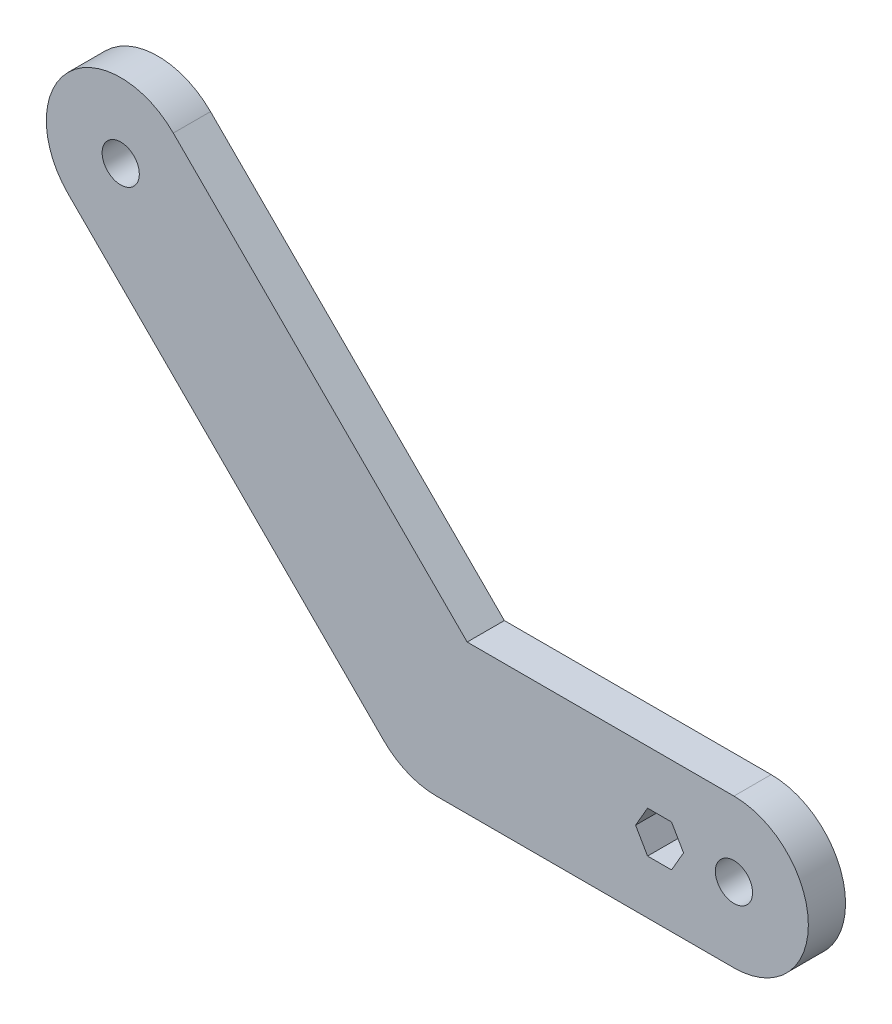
ISO-10303-21;
HEADER;
FILE_DESCRIPTION(('STEP AP214'),'2;1');
FILE_NAME('part.step','',(''),(''),'','','');
FILE_SCHEMA(('AUTOMOTIVE_DESIGN { 1 0 10303 214 1 1 1 1 }'));
ENDSEC;
DATA;
#1=APPLICATION_CONTEXT('core data for automotive mechanical design processes');
#2=APPLICATION_PROTOCOL_DEFINITION('international standard','automotive_design',2000,#1);
#3=PRODUCT_CONTEXT('',#1,'mechanical');
#4=PRODUCT('Part','Part','',(#3));
#5=PRODUCT_RELATED_PRODUCT_CATEGORY('part','',(#4));
#6=PRODUCT_DEFINITION_FORMATION('','',#4);
#7=PRODUCT_DEFINITION_CONTEXT('part definition',#1,'design');
#8=PRODUCT_DEFINITION('design','',#6,#7);
#9=PRODUCT_DEFINITION_SHAPE('','',#8);
#10=(LENGTH_UNIT() NAMED_UNIT(*) SI_UNIT(.MILLI.,.METRE.));
#11=(NAMED_UNIT(*) PLANE_ANGLE_UNIT() SI_UNIT($,.RADIAN.));
#12=(NAMED_UNIT(*) SI_UNIT($,.STERADIAN.) SOLID_ANGLE_UNIT());
#13=UNCERTAINTY_MEASURE_WITH_UNIT(LENGTH_MEASURE(1.E-05),#10,'distance_accuracy_value','');
#14=(GEOMETRIC_REPRESENTATION_CONTEXT(3) GLOBAL_UNCERTAINTY_ASSIGNED_CONTEXT((#13)) GLOBAL_UNIT_ASSIGNED_CONTEXT((#10,
#11,#12)) REPRESENTATION_CONTEXT('',''));
#15=CARTESIAN_POINT('',(0.,0.,0.));
#16=DIRECTION('',(0.,0.,1.));
#17=DIRECTION('',(1.,0.,0.));
#18=AXIS2_PLACEMENT_3D('',#15,#16,#17);
#19=CARTESIAN_POINT('',(0.,6.35,3.175));
#20=DIRECTION('',(0.,-1.,0.));
#21=DIRECTION('',(0.,0.,-1.));
#22=AXIS2_PLACEMENT_3D('',#19,#20,#21);
#23=PLANE('',#22);
#24=DIRECTION('',(0.,0.,-1.));
#25=VECTOR('',#24,1.);
#26=CARTESIAN_POINT('',(2.63025612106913,6.35,3.175));
#27=LINE('',#26,#25);
#28=CARTESIAN_POINT('',(2.63025612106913,6.35,3.175));
#29=VERTEX_POINT('',#28);
#30=CARTESIAN_POINT('',(2.63025612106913,6.35,0.));
#31=VERTEX_POINT('',#30);
#32=EDGE_CURVE('E11',#29,#31,#27,.T.);
#33=ORIENTED_EDGE('',*,*,#32,.F.);
#34=DIRECTION('',(-1.,0.,0.));
#35=VECTOR('',#34,1.);
#36=CARTESIAN_POINT('',(0.,6.35,3.175));
#37=LINE('',#36,#35);
#38=CARTESIAN_POINT('',(25.4,6.35,3.175));
#39=VERTEX_POINT('',#38);
#40=EDGE_CURVE('E134',#39,#29,#37,.T.);
#41=ORIENTED_EDGE('',*,*,#40,.F.);
#42=DIRECTION('',(0.,0.,-1.));
#43=VECTOR('',#42,1.);
#44=CARTESIAN_POINT('',(25.4,6.35,3.175));
#45=LINE('',#44,#43);
#46=CARTESIAN_POINT('',(25.4,6.35,0.));
#47=VERTEX_POINT('',#46);
#48=EDGE_CURVE('E222',#39,#47,#45,.T.);
#49=ORIENTED_EDGE('',*,*,#48,.T.);
#50=DIRECTION('',(-1.,0.,0.));
#51=VECTOR('',#50,1.);
#52=CARTESIAN_POINT('',(0.,6.35,0.));
#53=LINE('',#52,#51);
#54=EDGE_CURVE('E217',#47,#31,#53,.T.);
#55=ORIENTED_EDGE('',*,*,#54,.T.);
#56=EDGE_LOOP('',(#33,#41,#49,#55));
#57=FACE_BOUND('',#56,.T.);
#58=ADVANCED_FACE('F32',(#57),#23,.F.);
#59=CARTESIAN_POINT('',(0.,0.,3.175));
#60=DIRECTION('',(0.,0.,1.));
#61=DIRECTION('',(1.,0.,0.));
#62=AXIS2_PLACEMENT_3D('',#59,#60,#61);
#63=PLANE('',#62);
#64=CARTESIAN_POINT('',(0.,0.,3.175));
#65=DIRECTION('',(0.,0.,1.));
#66=DIRECTION('',(1.,0.,0.));
#67=AXIS2_PLACEMENT_3D('',#64,#65,#66);
#68=CIRCLE('',#67,6.35);
#69=CARTESIAN_POINT('',(-4.49012806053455,-4.4901280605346,3.175));
#70=VERTEX_POINT('',#69);
#71=CARTESIAN_POINT('',(0.,-6.35,3.175));
#72=VERTEX_POINT('',#71);
#73=EDGE_CURVE('E47',#70,#72,#68,.T.);
#74=ORIENTED_EDGE('',*,*,#73,.T.);
#75=DIRECTION('',(1.,0.,0.));
#76=VECTOR('',#75,1.);
#77=CARTESIAN_POINT('',(0.,-6.35,3.175));
#78=LINE('',#77,#76);
#79=CARTESIAN_POINT('',(25.4,-6.35,3.175));
#80=VERTEX_POINT('',#79);
#81=EDGE_CURVE('E216',#72,#80,#78,.T.);
#82=ORIENTED_EDGE('',*,*,#81,.T.);
#83=CARTESIAN_POINT('',(25.4,0.,3.175));
#84=DIRECTION('',(0.,0.,1.));
#85=DIRECTION('',(1.,0.,0.));
#86=AXIS2_PLACEMENT_3D('',#83,#84,#85);
#87=CIRCLE('',#86,6.35);
#88=EDGE_CURVE('E219',#80,#39,#87,.T.);
#89=ORIENTED_EDGE('',*,*,#88,.T.);
#90=ORIENTED_EDGE('',*,*,#40,.T.);
#91=DIRECTION('',(-0.707106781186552,0.707106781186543,0.));
#92=VECTOR('',#91,1.);
#93=CARTESIAN_POINT('',(4.49012806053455,4.4901280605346,3.175));
#94=LINE('',#93,#92);
#95=CARTESIAN_POINT('',(-22.4506403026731,31.4308964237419,3.175));
#96=VERTEX_POINT('',#95);
#97=EDGE_CURVE('E126',#29,#96,#94,.T.);
#98=ORIENTED_EDGE('',*,*,#97,.T.);
#99=CARTESIAN_POINT('',(-26.9407683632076,26.9407683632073,3.175));
#100=DIRECTION('',(0.,0.,1.));
#101=DIRECTION('',(1.,0.,0.));
#102=AXIS2_PLACEMENT_3D('',#99,#100,#101);
#103=CIRCLE('',#102,6.34999999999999);
#104=CARTESIAN_POINT('',(-31.4308964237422,22.4506403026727,3.175));
#105=VERTEX_POINT('',#104);
#106=EDGE_CURVE('E131',#96,#105,#103,.T.);
#107=ORIENTED_EDGE('',*,*,#106,.T.);
#108=DIRECTION('',(0.707106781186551,-0.707106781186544,0.));
#109=VECTOR('',#108,1.);
#110=CARTESIAN_POINT('',(-4.49012806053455,-4.4901280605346,3.175));
#111=LINE('',#110,#109);
#112=EDGE_CURVE('E151',#105,#70,#111,.T.);
#113=ORIENTED_EDGE('',*,*,#112,.T.);
#114=EDGE_LOOP('',(#74,#82,#89,#90,#98,#107,#113));
#115=FACE_BOUND('',#114,.T.);
#116=CARTESIAN_POINT('',(-26.9407683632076,26.9407683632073,3.175));
#117=DIRECTION('',(0.,0.,1.));
#118=DIRECTION('',(1.,0.,0.));
#119=AXIS2_PLACEMENT_3D('',#116,#117,#118);
#120=CIRCLE('',#119,1.5875);
#121=CARTESIAN_POINT('',(-25.3532683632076,26.9407683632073,3.175));
#122=VERTEX_POINT('',#121);
#123=EDGE_CURVE('E158',#122,#122,#120,.T.);
#124=ORIENTED_EDGE('',*,*,#123,.F.);
#125=EDGE_LOOP('',(#124));
#126=FACE_BOUND('',#125,.T.);
#127=CARTESIAN_POINT('',(25.4,0.,3.175));
#128=DIRECTION('',(0.,0.,1.));
#129=DIRECTION('',(1.,0.,0.));
#130=AXIS2_PLACEMENT_3D('',#127,#128,#129);
#131=CIRCLE('',#130,1.5875);
#132=CARTESIAN_POINT('',(26.9875,0.,3.175));
#133=VERTEX_POINT('',#132);
#134=EDGE_CURVE('E209',#133,#133,#131,.T.);
#135=ORIENTED_EDGE('',*,*,#134,.F.);
#136=EDGE_LOOP('',(#135));
#137=FACE_BOUND('',#136,.T.);
#138=DIRECTION('',(-0.499999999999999,-0.866025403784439,0.));
#139=VECTOR('',#138,1.);
#140=CARTESIAN_POINT('',(18.0268946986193,1.77207036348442,3.175));
#141=LINE('',#140,#139);
#142=CARTESIAN_POINT('',(18.0268946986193,1.77207036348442,3.175));
#143=VERTEX_POINT('',#142);
#144=CARTESIAN_POINT('',(17.0037893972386,0.,3.175));
#145=VERTEX_POINT('',#144);
#146=EDGE_CURVE('E166',#143,#145,#141,.T.);
#147=ORIENTED_EDGE('',*,*,#146,.F.);
#148=DIRECTION('',(-1.,0.,0.));
#149=VECTOR('',#148,1.);
#150=CARTESIAN_POINT('',(20.0731053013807,1.77207036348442,3.175));
#151=LINE('',#150,#149);
#152=CARTESIAN_POINT('',(20.0731053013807,1.77207036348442,3.175));
#153=VERTEX_POINT('',#152);
#154=EDGE_CURVE('E164',#153,#143,#151,.T.);
#155=ORIENTED_EDGE('',*,*,#154,.F.);
#156=DIRECTION('',(-0.500000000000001,0.866025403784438,0.));
#157=VECTOR('',#156,1.);
#158=CARTESIAN_POINT('',(21.0962106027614,0.,3.175));
#159=LINE('',#158,#157);
#160=CARTESIAN_POINT('',(21.0962106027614,0.,3.175));
#161=VERTEX_POINT('',#160);
#162=EDGE_CURVE('E176',#161,#153,#159,.T.);
#163=ORIENTED_EDGE('',*,*,#162,.F.);
#164=DIRECTION('',(0.500000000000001,0.866025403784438,0.));
#165=VECTOR('',#164,1.);
#166=CARTESIAN_POINT('',(20.0731053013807,-1.77207036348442,3.175));
#167=LINE('',#166,#165);
#168=CARTESIAN_POINT('',(20.0731053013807,-1.77207036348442,3.175));
#169=VERTEX_POINT('',#168);
#170=EDGE_CURVE('E173',#169,#161,#167,.T.);
#171=ORIENTED_EDGE('',*,*,#170,.F.);
#172=DIRECTION('',(1.,0.,0.));
#173=VECTOR('',#172,1.);
#174=CARTESIAN_POINT('',(18.0268946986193,-1.77207036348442,3.175));
#175=LINE('',#174,#173);
#176=CARTESIAN_POINT('',(18.0268946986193,-1.77207036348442,3.175));
#177=VERTEX_POINT('',#176);
#178=EDGE_CURVE('E171',#177,#169,#175,.T.);
#179=ORIENTED_EDGE('',*,*,#178,.F.);
#180=DIRECTION('',(0.5,-0.866025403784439,0.));
#181=VECTOR('',#180,1.);
#182=CARTESIAN_POINT('',(17.0037893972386,0.,3.175));
#183=LINE('',#182,#181);
#184=EDGE_CURVE('E169',#145,#177,#183,.T.);
#185=ORIENTED_EDGE('',*,*,#184,.F.);
#186=EDGE_LOOP('',(#147,#155,#163,#171,#179,#185));
#187=FACE_BOUND('',#186,.T.);
#188=ADVANCED_FACE('F128',(#115,#126,#137,#187),#63,.T.);
#189=CARTESIAN_POINT('',(0.,0.,0.));
#190=DIRECTION('',(0.,0.,1.));
#191=DIRECTION('',(1.,0.,0.));
#192=AXIS2_PLACEMENT_3D('',#189,#190,#191);
#193=PLANE('',#192);
#194=DIRECTION('',(1.,0.,0.));
#195=VECTOR('',#194,1.);
#196=CARTESIAN_POINT('',(0.,-6.35,0.));
#197=LINE('',#196,#195);
#198=CARTESIAN_POINT('',(0.,-6.35,0.));
#199=VERTEX_POINT('',#198);
#200=CARTESIAN_POINT('',(25.4,-6.35,0.));
#201=VERTEX_POINT('',#200);
#202=EDGE_CURVE('E224',#199,#201,#197,.T.);
#203=ORIENTED_EDGE('',*,*,#202,.F.);
#204=CARTESIAN_POINT('',(0.,0.,0.));
#205=DIRECTION('',(0.,0.,1.));
#206=DIRECTION('',(1.,0.,0.));
#207=AXIS2_PLACEMENT_3D('',#204,#205,#206);
#208=CIRCLE('',#207,6.35);
#209=CARTESIAN_POINT('',(-4.49012806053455,-4.4901280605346,0.));
#210=VERTEX_POINT('',#209);
#211=EDGE_CURVE('E212',#210,#199,#208,.T.);
#212=ORIENTED_EDGE('',*,*,#211,.F.);
#213=DIRECTION('',(0.707106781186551,-0.707106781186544,0.));
#214=VECTOR('',#213,1.);
#215=CARTESIAN_POINT('',(-4.49012806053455,-4.4901280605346,0.));
#216=LINE('',#215,#214);
#217=CARTESIAN_POINT('',(-31.4308964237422,22.4506403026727,0.));
#218=VERTEX_POINT('',#217);
#219=EDGE_CURVE('E136',#218,#210,#216,.T.);
#220=ORIENTED_EDGE('',*,*,#219,.F.);
#221=CARTESIAN_POINT('',(-26.9407683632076,26.9407683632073,0.));
#222=DIRECTION('',(0.,0.,1.));
#223=DIRECTION('',(1.,0.,0.));
#224=AXIS2_PLACEMENT_3D('',#221,#222,#223);
#225=CIRCLE('',#224,6.34999999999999);
#226=CARTESIAN_POINT('',(-22.4506403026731,31.4308964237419,0.));
#227=VERTEX_POINT('',#226);
#228=EDGE_CURVE('E157',#227,#218,#225,.T.);
#229=ORIENTED_EDGE('',*,*,#228,.F.);
#230=DIRECTION('',(-0.707106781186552,0.707106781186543,0.));
#231=VECTOR('',#230,1.);
#232=CARTESIAN_POINT('',(4.49012806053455,4.4901280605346,0.));
#233=LINE('',#232,#231);
#234=EDGE_CURVE('E142',#31,#227,#233,.T.);
#235=ORIENTED_EDGE('',*,*,#234,.F.);
#236=ORIENTED_EDGE('',*,*,#54,.F.);
#237=CARTESIAN_POINT('',(25.4,0.,0.));
#238=DIRECTION('',(0.,0.,1.));
#239=DIRECTION('',(1.,0.,0.));
#240=AXIS2_PLACEMENT_3D('',#237,#238,#239);
#241=CIRCLE('',#240,6.35);
#242=EDGE_CURVE('E226',#201,#47,#241,.T.);
#243=ORIENTED_EDGE('',*,*,#242,.F.);
#244=EDGE_LOOP('',(#203,#212,#220,#229,#235,#236,#243));
#245=FACE_BOUND('',#244,.T.);
#246=CARTESIAN_POINT('',(-26.9407683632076,26.9407683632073,0.));
#247=DIRECTION('',(0.,0.,1.));
#248=DIRECTION('',(1.,0.,0.));
#249=AXIS2_PLACEMENT_3D('',#246,#247,#248);
#250=CIRCLE('',#249,1.5875);
#251=CARTESIAN_POINT('',(-25.3532683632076,26.9407683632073,0.));
#252=VERTEX_POINT('',#251);
#253=EDGE_CURVE('E435',#252,#252,#250,.T.);
#254=ORIENTED_EDGE('',*,*,#253,.T.);
#255=EDGE_LOOP('',(#254));
#256=FACE_BOUND('',#255,.T.);
#257=DIRECTION('',(-1.,0.,0.));
#258=VECTOR('',#257,1.);
#259=CARTESIAN_POINT('',(20.0731053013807,1.77207036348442,0.));
#260=LINE('',#259,#258);
#261=CARTESIAN_POINT('',(20.0731053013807,1.77207036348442,0.));
#262=VERTEX_POINT('',#261);
#263=CARTESIAN_POINT('',(18.0268946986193,1.77207036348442,0.));
#264=VERTEX_POINT('',#263);
#265=EDGE_CURVE('E145',#262,#264,#260,.T.);
#266=ORIENTED_EDGE('',*,*,#265,.T.);
#267=DIRECTION('',(-0.499999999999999,-0.866025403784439,0.));
#268=VECTOR('',#267,1.);
#269=CARTESIAN_POINT('',(18.0268946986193,1.77207036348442,0.));
#270=LINE('',#269,#268);
#271=CARTESIAN_POINT('',(17.0037893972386,0.,0.));
#272=VERTEX_POINT('',#271);
#273=EDGE_CURVE('E181',#264,#272,#270,.T.);
#274=ORIENTED_EDGE('',*,*,#273,.T.);
#275=DIRECTION('',(0.5,-0.866025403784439,0.));
#276=VECTOR('',#275,1.);
#277=CARTESIAN_POINT('',(17.0037893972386,0.,0.));
#278=LINE('',#277,#276);
#279=CARTESIAN_POINT('',(18.0268946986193,-1.77207036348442,0.));
#280=VERTEX_POINT('',#279);
#281=EDGE_CURVE('E184',#272,#280,#278,.T.);
#282=ORIENTED_EDGE('',*,*,#281,.T.);
#283=DIRECTION('',(1.,0.,0.));
#284=VECTOR('',#283,1.);
#285=CARTESIAN_POINT('',(18.0268946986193,-1.77207036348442,0.));
#286=LINE('',#285,#284);
#287=CARTESIAN_POINT('',(20.0731053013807,-1.77207036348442,0.));
#288=VERTEX_POINT('',#287);
#289=EDGE_CURVE('E187',#280,#288,#286,.T.);
#290=ORIENTED_EDGE('',*,*,#289,.T.);
#291=DIRECTION('',(0.500000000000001,0.866025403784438,0.));
#292=VECTOR('',#291,1.);
#293=CARTESIAN_POINT('',(20.0731053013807,-1.77207036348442,0.));
#294=LINE('',#293,#292);
#295=CARTESIAN_POINT('',(21.0962106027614,0.,0.));
#296=VERTEX_POINT('',#295);
#297=EDGE_CURVE('E190',#288,#296,#294,.T.);
#298=ORIENTED_EDGE('',*,*,#297,.T.);
#299=DIRECTION('',(-0.500000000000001,0.866025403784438,0.));
#300=VECTOR('',#299,1.);
#301=CARTESIAN_POINT('',(21.0962106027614,0.,0.));
#302=LINE('',#301,#300);
#303=EDGE_CURVE('E167',#296,#262,#302,.T.);
#304=ORIENTED_EDGE('',*,*,#303,.T.);
#305=EDGE_LOOP('',(#266,#274,#282,#290,#298,#304));
#306=FACE_BOUND('',#305,.T.);
#307=CARTESIAN_POINT('',(25.4,0.,0.));
#308=DIRECTION('',(0.,0.,1.));
#309=DIRECTION('',(1.,0.,0.));
#310=AXIS2_PLACEMENT_3D('',#307,#308,#309);
#311=CIRCLE('',#310,1.5875);
#312=CARTESIAN_POINT('',(26.9875,0.,0.));
#313=VERTEX_POINT('',#312);
#314=EDGE_CURVE('E208',#313,#313,#311,.T.);
#315=ORIENTED_EDGE('',*,*,#314,.T.);
#316=EDGE_LOOP('',(#315));
#317=FACE_BOUND('',#316,.T.);
#318=ADVANCED_FACE('F242',(#245,#256,#306,#317),#193,.F.);
#319=CARTESIAN_POINT('',(0.,0.,3.175));
#320=DIRECTION('',(0.,0.,-1.));
#321=DIRECTION('',(-1.,0.,0.));
#322=AXIS2_PLACEMENT_3D('',#319,#320,#321);
#323=CYLINDRICAL_SURFACE('',#322,6.35);
#324=ORIENTED_EDGE('',*,*,#73,.F.);
#325=DIRECTION('',(0.,0.,-1.));
#326=VECTOR('',#325,1.);
#327=CARTESIAN_POINT('',(-4.49012806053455,-4.4901280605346,3.175));
#328=LINE('',#327,#326);
#329=EDGE_CURVE('E52',#70,#210,#328,.T.);
#330=ORIENTED_EDGE('',*,*,#329,.T.);
#331=ORIENTED_EDGE('',*,*,#211,.T.);
#332=DIRECTION('',(0.,0.,-1.));
#333=VECTOR('',#332,1.);
#334=CARTESIAN_POINT('',(0.,-6.35,3.175));
#335=LINE('',#334,#333);
#336=EDGE_CURVE('E40',#72,#199,#335,.T.);
#337=ORIENTED_EDGE('',*,*,#336,.F.);
#338=EDGE_LOOP('',(#324,#330,#331,#337));
#339=FACE_BOUND('',#338,.T.);
#340=ADVANCED_FACE('F34',(#339),#323,.T.);
#341=CARTESIAN_POINT('',(0.,-6.35,3.175));
#342=DIRECTION('',(0.,1.,0.));
#343=DIRECTION('',(0.,0.,1.));
#344=AXIS2_PLACEMENT_3D('',#341,#342,#343);
#345=PLANE('',#344);
#346=ORIENTED_EDGE('',*,*,#202,.T.);
#347=DIRECTION('',(0.,0.,-1.));
#348=VECTOR('',#347,1.);
#349=CARTESIAN_POINT('',(25.4,-6.35,3.175));
#350=LINE('',#349,#348);
#351=EDGE_CURVE('E231',#80,#201,#350,.T.);
#352=ORIENTED_EDGE('',*,*,#351,.F.);
#353=ORIENTED_EDGE('',*,*,#81,.F.);
#354=ORIENTED_EDGE('',*,*,#336,.T.);
#355=EDGE_LOOP('',(#346,#352,#353,#354));
#356=FACE_BOUND('',#355,.T.);
#357=ADVANCED_FACE('F236',(#356),#345,.F.);
#358=CARTESIAN_POINT('',(25.4,0.,3.175));
#359=DIRECTION('',(0.,0.,-1.));
#360=DIRECTION('',(-1.,0.,0.));
#361=AXIS2_PLACEMENT_3D('',#358,#359,#360);
#362=CYLINDRICAL_SURFACE('',#361,6.35);
#363=ORIENTED_EDGE('',*,*,#242,.T.);
#364=ORIENTED_EDGE('',*,*,#48,.F.);
#365=ORIENTED_EDGE('',*,*,#88,.F.);
#366=ORIENTED_EDGE('',*,*,#351,.T.);
#367=EDGE_LOOP('',(#363,#364,#365,#366));
#368=FACE_BOUND('',#367,.T.);
#369=ADVANCED_FACE('F247',(#368),#362,.T.);
#370=CARTESIAN_POINT('',(25.4,0.,3.175));
#371=DIRECTION('',(0.,0.,-1.));
#372=DIRECTION('',(-1.,0.,0.));
#373=AXIS2_PLACEMENT_3D('',#370,#371,#372);
#374=CYLINDRICAL_SURFACE('',#373,1.5875);
#375=ORIENTED_EDGE('',*,*,#134,.T.);
#376=EDGE_LOOP('',(#375));
#377=FACE_BOUND('',#376,.T.);
#378=ORIENTED_EDGE('',*,*,#314,.F.);
#379=EDGE_LOOP('',(#378));
#380=FACE_BOUND('',#379,.T.);
#381=ADVANCED_FACE('F271',(#377,#380),#374,.F.);
#382=CARTESIAN_POINT('',(20.0731053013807,1.77207036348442,3.175));
#383=DIRECTION('',(0.,-1.,0.));
#384=DIRECTION('',(1.,0.,0.));
#385=AXIS2_PLACEMENT_3D('',#382,#383,#384);
#386=PLANE('',#385);
#387=ORIENTED_EDGE('',*,*,#265,.F.);
#388=DIRECTION('',(0.,0.,-1.));
#389=VECTOR('',#388,1.);
#390=CARTESIAN_POINT('',(20.0731053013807,1.77207036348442,3.175));
#391=LINE('',#390,#389);
#392=EDGE_CURVE('E178',#153,#262,#391,.T.);
#393=ORIENTED_EDGE('',*,*,#392,.F.);
#394=ORIENTED_EDGE('',*,*,#154,.T.);
#395=DIRECTION('',(0.,0.,-1.));
#396=VECTOR('',#395,1.);
#397=CARTESIAN_POINT('',(18.0268946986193,1.77207036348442,3.175));
#398=LINE('',#397,#396);
#399=EDGE_CURVE('E205',#143,#264,#398,.T.);
#400=ORIENTED_EDGE('',*,*,#399,.T.);
#401=EDGE_LOOP('',(#387,#393,#394,#400));
#402=FACE_BOUND('',#401,.T.);
#403=ADVANCED_FACE('F341',(#402),#386,.T.);
#404=CARTESIAN_POINT('',(18.0268946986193,1.77207036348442,3.175));
#405=DIRECTION('',(0.866025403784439,-0.499999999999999,0.));
#406=DIRECTION('',(0.499999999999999,0.866025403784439,0.));
#407=AXIS2_PLACEMENT_3D('',#404,#405,#406);
#408=PLANE('',#407);
#409=ORIENTED_EDGE('',*,*,#273,.F.);
#410=ORIENTED_EDGE('',*,*,#399,.F.);
#411=ORIENTED_EDGE('',*,*,#146,.T.);
#412=DIRECTION('',(0.,0.,-1.));
#413=VECTOR('',#412,1.);
#414=CARTESIAN_POINT('',(17.0037893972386,0.,3.175));
#415=LINE('',#414,#413);
#416=EDGE_CURVE('E203',#145,#272,#415,.T.);
#417=ORIENTED_EDGE('',*,*,#416,.T.);
#418=EDGE_LOOP('',(#409,#410,#411,#417));
#419=FACE_BOUND('',#418,.T.);
#420=ADVANCED_FACE('F331',(#419),#408,.T.);
#421=CARTESIAN_POINT('',(17.0037893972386,0.,3.175));
#422=DIRECTION('',(0.866025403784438,0.5,0.));
#423=DIRECTION('',(-0.5,0.866025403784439,0.));
#424=AXIS2_PLACEMENT_3D('',#421,#422,#423);
#425=PLANE('',#424);
#426=ORIENTED_EDGE('',*,*,#281,.F.);
#427=ORIENTED_EDGE('',*,*,#416,.F.);
#428=ORIENTED_EDGE('',*,*,#184,.T.);
#429=DIRECTION('',(0.,0.,-1.));
#430=VECTOR('',#429,1.);
#431=CARTESIAN_POINT('',(18.0268946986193,-1.77207036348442,3.175));
#432=LINE('',#431,#430);
#433=EDGE_CURVE('E201',#177,#280,#432,.T.);
#434=ORIENTED_EDGE('',*,*,#433,.T.);
#435=EDGE_LOOP('',(#426,#427,#428,#434));
#436=FACE_BOUND('',#435,.T.);
#437=ADVANCED_FACE('F321',(#436),#425,.T.);
#438=CARTESIAN_POINT('',(18.0268946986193,-1.77207036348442,3.175));
#439=DIRECTION('',(0.,1.,0.));
#440=DIRECTION('',(-1.,0.,0.));
#441=AXIS2_PLACEMENT_3D('',#438,#439,#440);
#442=PLANE('',#441);
#443=ORIENTED_EDGE('',*,*,#289,.F.);
#444=ORIENTED_EDGE('',*,*,#433,.F.);
#445=ORIENTED_EDGE('',*,*,#178,.T.);
#446=DIRECTION('',(0.,0.,-1.));
#447=VECTOR('',#446,1.);
#448=CARTESIAN_POINT('',(20.0731053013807,-1.77207036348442,3.175));
#449=LINE('',#448,#447);
#450=EDGE_CURVE('E199',#169,#288,#449,.T.);
#451=ORIENTED_EDGE('',*,*,#450,.T.);
#452=EDGE_LOOP('',(#443,#444,#445,#451));
#453=FACE_BOUND('',#452,.T.);
#454=ADVANCED_FACE('F311',(#453),#442,.T.);
#455=CARTESIAN_POINT('',(20.0731053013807,-1.77207036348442,3.175));
#456=DIRECTION('',(-0.866025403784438,0.500000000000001,0.));
#457=DIRECTION('',(-0.500000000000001,-0.866025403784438,0.));
#458=AXIS2_PLACEMENT_3D('',#455,#456,#457);
#459=PLANE('',#458);
#460=ORIENTED_EDGE('',*,*,#297,.F.);
#461=ORIENTED_EDGE('',*,*,#450,.F.);
#462=ORIENTED_EDGE('',*,*,#170,.T.);
#463=DIRECTION('',(0.,0.,-1.));
#464=VECTOR('',#463,1.);
#465=CARTESIAN_POINT('',(21.0962106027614,0.,3.175));
#466=LINE('',#465,#464);
#467=EDGE_CURVE('E197',#161,#296,#466,.T.);
#468=ORIENTED_EDGE('',*,*,#467,.T.);
#469=EDGE_LOOP('',(#460,#461,#462,#468));
#470=FACE_BOUND('',#469,.T.);
#471=ADVANCED_FACE('F300',(#470),#459,.T.);
#472=CARTESIAN_POINT('',(21.0962106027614,0.,3.175));
#473=DIRECTION('',(-0.866025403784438,-0.5,0.));
#474=DIRECTION('',(0.500000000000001,-0.866025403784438,0.));
#475=AXIS2_PLACEMENT_3D('',#472,#473,#474);
#476=PLANE('',#475);
#477=ORIENTED_EDGE('',*,*,#303,.F.);
#478=ORIENTED_EDGE('',*,*,#467,.F.);
#479=ORIENTED_EDGE('',*,*,#162,.T.);
#480=ORIENTED_EDGE('',*,*,#392,.T.);
#481=EDGE_LOOP('',(#477,#478,#479,#480));
#482=FACE_BOUND('',#481,.T.);
#483=ADVANCED_FACE('F296',(#482),#476,.T.);
#484=CARTESIAN_POINT('',(4.49012806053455,4.4901280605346,3.175));
#485=DIRECTION('',(-0.707106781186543,-0.707106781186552,0.));
#486=DIRECTION('',(0.707106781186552,-0.707106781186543,0.));
#487=AXIS2_PLACEMENT_3D('',#484,#485,#486);
#488=PLANE('',#487);
#489=ORIENTED_EDGE('',*,*,#97,.F.);
#490=ORIENTED_EDGE('',*,*,#32,.T.);
#491=ORIENTED_EDGE('',*,*,#234,.T.);
#492=DIRECTION('',(0.,0.,-1.));
#493=VECTOR('',#492,1.);
#494=CARTESIAN_POINT('',(-22.4506403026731,31.4308964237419,3.175));
#495=LINE('',#494,#493);
#496=EDGE_CURVE('E139',#96,#227,#495,.T.);
#497=ORIENTED_EDGE('',*,*,#496,.F.);
#498=EDGE_LOOP('',(#489,#490,#491,#497));
#499=FACE_BOUND('',#498,.T.);
#500=ADVANCED_FACE('F140',(#499),#488,.F.);
#501=CARTESIAN_POINT('',(-26.9407683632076,26.9407683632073,3.175));
#502=DIRECTION('',(0.,0.,-1.));
#503=DIRECTION('',(-1.,0.,0.));
#504=AXIS2_PLACEMENT_3D('',#501,#502,#503);
#505=CYLINDRICAL_SURFACE('',#504,6.34999999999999);
#506=ORIENTED_EDGE('',*,*,#228,.T.);
#507=DIRECTION('',(0.,0.,-1.));
#508=VECTOR('',#507,1.);
#509=CARTESIAN_POINT('',(-31.4308964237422,22.4506403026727,3.175));
#510=LINE('',#509,#508);
#511=EDGE_CURVE('E146',#105,#218,#510,.T.);
#512=ORIENTED_EDGE('',*,*,#511,.F.);
#513=ORIENTED_EDGE('',*,*,#106,.F.);
#514=ORIENTED_EDGE('',*,*,#496,.T.);
#515=EDGE_LOOP('',(#506,#512,#513,#514));
#516=FACE_BOUND('',#515,.T.);
#517=ADVANCED_FACE('F148',(#516),#505,.T.);
#518=CARTESIAN_POINT('',(-4.49012806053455,-4.4901280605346,3.175));
#519=DIRECTION('',(0.707106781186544,0.707106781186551,0.));
#520=DIRECTION('',(-0.707106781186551,0.707106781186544,0.));
#521=AXIS2_PLACEMENT_3D('',#518,#519,#520);
#522=PLANE('',#521);
#523=ORIENTED_EDGE('',*,*,#219,.T.);
#524=ORIENTED_EDGE('',*,*,#329,.F.);
#525=ORIENTED_EDGE('',*,*,#112,.F.);
#526=ORIENTED_EDGE('',*,*,#511,.T.);
#527=EDGE_LOOP('',(#523,#524,#525,#526));
#528=FACE_BOUND('',#527,.T.);
#529=ADVANCED_FACE('F251',(#528),#522,.F.);
#530=CARTESIAN_POINT('',(-26.9407683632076,26.9407683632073,3.175));
#531=DIRECTION('',(0.,0.,-1.));
#532=DIRECTION('',(-1.,0.,0.));
#533=AXIS2_PLACEMENT_3D('',#530,#531,#532);
#534=CYLINDRICAL_SURFACE('',#533,1.5875);
#535=ORIENTED_EDGE('',*,*,#123,.T.);
#536=EDGE_LOOP('',(#535));
#537=FACE_BOUND('',#536,.T.);
#538=ORIENTED_EDGE('',*,*,#253,.F.);
#539=EDGE_LOOP('',(#538));
#540=FACE_BOUND('',#539,.T.);
#541=ADVANCED_FACE('F253',(#537,#540),#534,.F.);
#542=CLOSED_SHELL('',(#58,#188,#318,#340,#357,#369,#381,#403,#420,#437,#454,#471,#483,#500,#517,
#529,#541));
#543=MANIFOLD_SOLID_BREP('B2',#542);
#544=ADVANCED_BREP_SHAPE_REPRESENTATION('',(#18,#543),#14);
#545=SHAPE_DEFINITION_REPRESENTATION(#9,#544);
ENDSEC;
END-ISO-10303-21;
